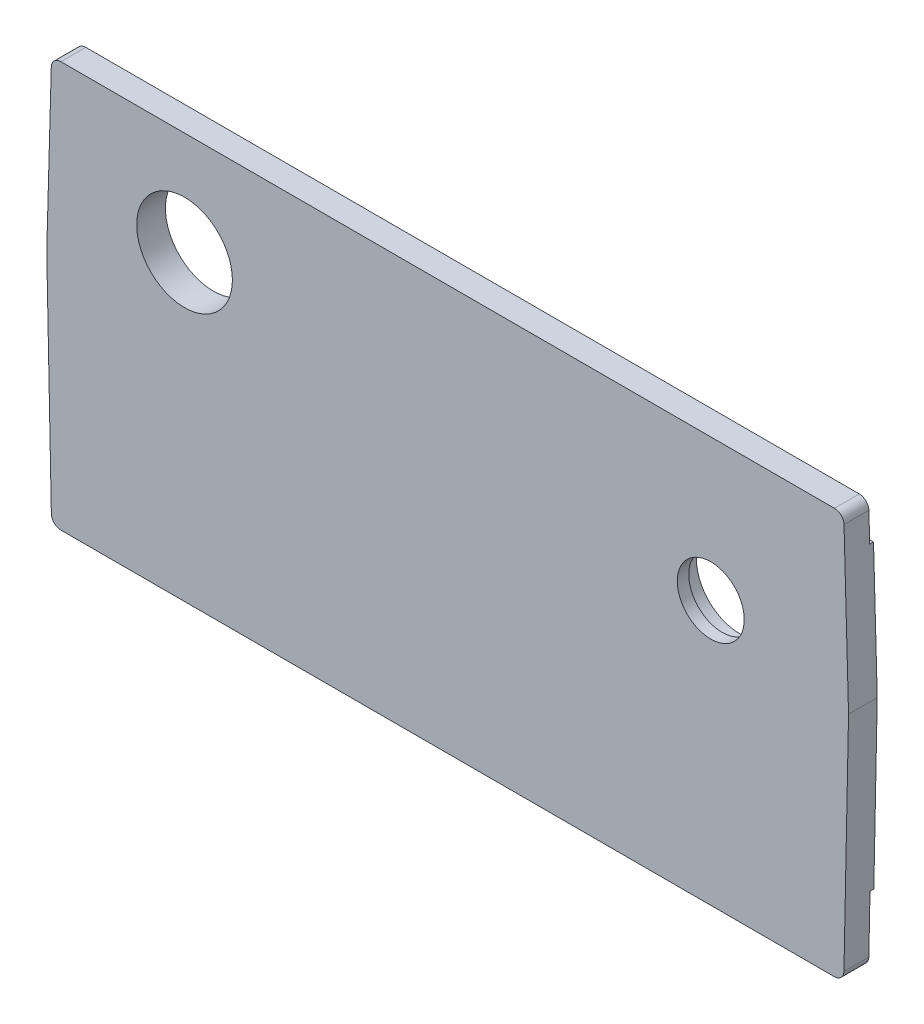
ISO-10303-21;
HEADER;
FILE_DESCRIPTION(('STEP AP214'),'2;1');
FILE_NAME('part.step','',(''),(''),'','','');
FILE_SCHEMA(('AUTOMOTIVE_DESIGN { 1 0 10303 214 1 1 1 1 }'));
ENDSEC;
DATA;
#1=APPLICATION_CONTEXT('core data for automotive mechanical design processes');
#2=APPLICATION_PROTOCOL_DEFINITION('international standard','automotive_design',2000,#1);
#3=PRODUCT_CONTEXT('',#1,'mechanical');
#4=PRODUCT('Part','Part','',(#3));
#5=PRODUCT_RELATED_PRODUCT_CATEGORY('part','',(#4));
#6=PRODUCT_DEFINITION_FORMATION('','',#4);
#7=PRODUCT_DEFINITION_CONTEXT('part definition',#1,'design');
#8=PRODUCT_DEFINITION('design','',#6,#7);
#9=PRODUCT_DEFINITION_SHAPE('','',#8);
#10=(LENGTH_UNIT() NAMED_UNIT(*) SI_UNIT(.MILLI.,.METRE.));
#11=(NAMED_UNIT(*) PLANE_ANGLE_UNIT() SI_UNIT($,.RADIAN.));
#12=(NAMED_UNIT(*) SI_UNIT($,.STERADIAN.) SOLID_ANGLE_UNIT());
#13=UNCERTAINTY_MEASURE_WITH_UNIT(LENGTH_MEASURE(1.E-05),#10,'distance_accuracy_value','');
#14=(GEOMETRIC_REPRESENTATION_CONTEXT(3) GLOBAL_UNCERTAINTY_ASSIGNED_CONTEXT((#13)) GLOBAL_UNIT_ASSIGNED_CONTEXT((#10,
#11,#12)) REPRESENTATION_CONTEXT('',''));
#15=CARTESIAN_POINT('',(0.,0.,0.));
#16=DIRECTION('',(0.,0.,1.));
#17=DIRECTION('',(1.,0.,0.));
#18=AXIS2_PLACEMENT_3D('',#15,#16,#17);
#19=CARTESIAN_POINT('',(1.47980006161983,1.,3.));
#20=DIRECTION('',(0.,0.,-1.));
#21=DIRECTION('',(-1.,0.,0.));
#22=AXIS2_PLACEMENT_3D('',#19,#20,#21);
#23=CYLINDRICAL_SURFACE('',#22,1.);
#24=CARTESIAN_POINT('',(1.47980006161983,1.,0.4));
#25=DIRECTION('',(0.,0.,-1.));
#26=DIRECTION('',(-1.,0.,0.));
#27=AXIS2_PLACEMENT_3D('',#24,#25,#26);
#28=CIRCLE('',#27,1.);
#29=CARTESIAN_POINT('',(1.47980006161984,0.,0.4));
#30=VERTEX_POINT('',#29);
#31=CARTESIAN_POINT('',(0.480008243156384,0.979596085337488,0.4));
#32=VERTEX_POINT('',#31);
#33=EDGE_CURVE('E47',#30,#32,#28,.T.);
#34=ORIENTED_EDGE('',*,*,#33,.F.);
#35=DIRECTION('',(0.,0.,-1.));
#36=VECTOR('',#35,1.);
#37=CARTESIAN_POINT('',(1.47980006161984,0.,3.));
#38=LINE('',#37,#36);
#39=CARTESIAN_POINT('',(1.47980006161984,0.,3.));
#40=VERTEX_POINT('',#39);
#41=EDGE_CURVE('E191',#40,#30,#38,.T.);
#42=ORIENTED_EDGE('',*,*,#41,.F.);
#43=CARTESIAN_POINT('',(1.47980006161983,1.,3.));
#44=DIRECTION('',(0.,0.,1.));
#45=DIRECTION('',(1.,0.,0.));
#46=AXIS2_PLACEMENT_3D('',#43,#44,#45);
#47=CIRCLE('',#46,1.);
#48=CARTESIAN_POINT('',(0.480008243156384,0.979596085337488,3.));
#49=VERTEX_POINT('',#48);
#50=EDGE_CURVE('E155',#49,#40,#47,.T.);
#51=ORIENTED_EDGE('',*,*,#50,.F.);
#52=DIRECTION('',(0.,0.,-1.));
#53=VECTOR('',#52,1.);
#54=CARTESIAN_POINT('',(0.480008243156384,0.979596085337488,3.));
#55=LINE('',#54,#53);
#56=EDGE_CURVE('E165',#49,#32,#55,.T.);
#57=ORIENTED_EDGE('',*,*,#56,.T.);
#58=EDGE_LOOP('',(#34,#42,#51,#57));
#59=FACE_BOUND('',#58,.T.);
#60=ADVANCED_FACE('F33',(#59),#23,.T.);
#61=CARTESIAN_POINT('',(1.47980006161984,0.,3.));
#62=DIRECTION('',(0.,1.,0.));
#63=DIRECTION('',(0.,0.,1.));
#64=AXIS2_PLACEMENT_3D('',#61,#62,#63);
#65=PLANE('',#64);
#66=DIRECTION('',(-1.,0.,0.));
#67=VECTOR('',#66,1.);
#68=CARTESIAN_POINT('',(85.1998639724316,0.,0.4));
#69=LINE('',#68,#67);
#70=CARTESIAN_POINT('',(82.3201999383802,0.,0.4));
#71=VERTEX_POINT('',#70);
#72=EDGE_CURVE('E148',#71,#30,#69,.T.);
#73=ORIENTED_EDGE('',*,*,#72,.F.);
#74=DIRECTION('',(0.,0.,-1.));
#75=VECTOR('',#74,1.);
#76=CARTESIAN_POINT('',(82.3201999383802,0.,3.));
#77=LINE('',#76,#75);
#78=CARTESIAN_POINT('',(82.3201999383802,0.,3.));
#79=VERTEX_POINT('',#78);
#80=EDGE_CURVE('E188',#79,#71,#77,.T.);
#81=ORIENTED_EDGE('',*,*,#80,.F.);
#82=DIRECTION('',(1.,0.,0.));
#83=VECTOR('',#82,1.);
#84=CARTESIAN_POINT('',(1.47980006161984,0.,3.));
#85=LINE('',#84,#83);
#86=EDGE_CURVE('E159',#40,#79,#85,.T.);
#87=ORIENTED_EDGE('',*,*,#86,.F.);
#88=ORIENTED_EDGE('',*,*,#41,.T.);
#89=EDGE_LOOP('',(#73,#81,#87,#88));
#90=FACE_BOUND('',#89,.T.);
#91=ADVANCED_FACE('F293',(#90),#65,.F.);
#92=CARTESIAN_POINT('',(82.3201999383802,1.,3.));
#93=DIRECTION('',(0.,0.,-1.));
#94=DIRECTION('',(-1.,0.,0.));
#95=AXIS2_PLACEMENT_3D('',#92,#93,#94);
#96=CYLINDRICAL_SURFACE('',#95,1.00000000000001);
#97=CARTESIAN_POINT('',(82.3201999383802,1.,0.4));
#98=DIRECTION('',(0.,0.,-1.));
#99=DIRECTION('',(-1.,0.,0.));
#100=AXIS2_PLACEMENT_3D('',#97,#98,#99);
#101=CIRCLE('',#100,1.00000000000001);
#102=CARTESIAN_POINT('',(83.3199917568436,0.979596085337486,0.4));
#103=VERTEX_POINT('',#102);
#104=EDGE_CURVE('E236',#103,#71,#101,.T.);
#105=ORIENTED_EDGE('',*,*,#104,.F.);
#106=DIRECTION('',(0.,0.,-1.));
#107=VECTOR('',#106,1.);
#108=CARTESIAN_POINT('',(83.3199917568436,0.979596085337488,3.));
#109=LINE('',#108,#107);
#110=CARTESIAN_POINT('',(83.3199917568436,0.979596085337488,3.));
#111=VERTEX_POINT('',#110);
#112=EDGE_CURVE('E185',#111,#103,#109,.T.);
#113=ORIENTED_EDGE('',*,*,#112,.F.);
#114=CARTESIAN_POINT('',(82.3201999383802,1.,3.));
#115=DIRECTION('',(0.,0.,1.));
#116=DIRECTION('',(-1.,0.,0.));
#117=AXIS2_PLACEMENT_3D('',#114,#115,#116);
#118=CIRCLE('',#117,1.00000000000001);
#119=EDGE_CURVE('E260',#79,#111,#118,.T.);
#120=ORIENTED_EDGE('',*,*,#119,.F.);
#121=ORIENTED_EDGE('',*,*,#80,.T.);
#122=EDGE_LOOP('',(#105,#113,#120,#121));
#123=FACE_BOUND('',#122,.T.);
#124=ADVANCED_FACE('F297',(#123),#96,.T.);
#125=CARTESIAN_POINT('',(82.3275429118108,41.4,3.));
#126=DIRECTION('',(0.,0.,-1.));
#127=DIRECTION('',(-1.,0.,0.));
#128=AXIS2_PLACEMENT_3D('',#125,#126,#127);
#129=CYLINDRICAL_SURFACE('',#128,1.);
#130=CARTESIAN_POINT('',(82.3275429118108,41.4,0.4));
#131=DIRECTION('',(0.,0.,-1.));
#132=DIRECTION('',(-1.,0.,0.));
#133=AXIS2_PLACEMENT_3D('',#130,#131,#132);
#134=CIRCLE('',#133,1.);
#135=CARTESIAN_POINT('',(82.3275429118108,42.4,0.4));
#136=VERTEX_POINT('',#135);
#137=CARTESIAN_POINT('',(83.3271530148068,41.4279220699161,0.4));
#138=VERTEX_POINT('',#137);
#139=EDGE_CURVE('E242',#136,#138,#134,.T.);
#140=ORIENTED_EDGE('',*,*,#139,.F.);
#141=DIRECTION('',(0.,0.,-1.));
#142=VECTOR('',#141,1.);
#143=CARTESIAN_POINT('',(82.3275429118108,42.4,3.));
#144=LINE('',#143,#142);
#145=CARTESIAN_POINT('',(82.3275429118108,42.4,3.));
#146=VERTEX_POINT('',#145);
#147=EDGE_CURVE('E176',#146,#136,#144,.T.);
#148=ORIENTED_EDGE('',*,*,#147,.F.);
#149=CARTESIAN_POINT('',(82.3275429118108,41.4,3.));
#150=DIRECTION('',(0.,0.,1.));
#151=DIRECTION('',(1.,0.,0.));
#152=AXIS2_PLACEMENT_3D('',#149,#150,#151);
#153=CIRCLE('',#152,1.);
#154=CARTESIAN_POINT('',(83.3271530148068,41.4279220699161,3.));
#155=VERTEX_POINT('',#154);
#156=EDGE_CURVE('E266',#155,#146,#153,.T.);
#157=ORIENTED_EDGE('',*,*,#156,.F.);
#158=DIRECTION('',(0.,0.,-1.));
#159=VECTOR('',#158,1.);
#160=CARTESIAN_POINT('',(83.3271530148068,41.4279220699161,3.));
#161=LINE('',#160,#159);
#162=EDGE_CURVE('E179',#155,#138,#161,.T.);
#163=ORIENTED_EDGE('',*,*,#162,.T.);
#164=EDGE_LOOP('',(#140,#148,#157,#163));
#165=FACE_BOUND('',#164,.T.);
#166=ADVANCED_FACE('F302',(#165),#129,.T.);
#167=CARTESIAN_POINT('',(1.47245708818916,42.4,3.));
#168=DIRECTION('',(0.,-1.,0.));
#169=DIRECTION('',(0.,0.,-1.));
#170=AXIS2_PLACEMENT_3D('',#167,#168,#169);
#171=PLANE('',#170);
#172=DIRECTION('',(1.,0.,0.));
#173=VECTOR('',#172,1.);
#174=CARTESIAN_POINT('',(85.1998639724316,42.4,0.4));
#175=LINE('',#174,#173);
#176=CARTESIAN_POINT('',(1.47245708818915,42.4,0.4));
#177=VERTEX_POINT('',#176);
#178=EDGE_CURVE('E234',#177,#136,#175,.T.);
#179=ORIENTED_EDGE('',*,*,#178,.F.);
#180=DIRECTION('',(0.,0.,-1.));
#181=VECTOR('',#180,1.);
#182=CARTESIAN_POINT('',(1.47245708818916,42.4,3.));
#183=LINE('',#182,#181);
#184=CARTESIAN_POINT('',(1.47245708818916,42.4,3.));
#185=VERTEX_POINT('',#184);
#186=EDGE_CURVE('E173',#185,#177,#183,.T.);
#187=ORIENTED_EDGE('',*,*,#186,.F.);
#188=DIRECTION('',(-1.,0.,0.));
#189=VECTOR('',#188,1.);
#190=CARTESIAN_POINT('',(1.47245708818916,42.4,3.));
#191=LINE('',#190,#189);
#192=EDGE_CURVE('E268',#146,#185,#191,.T.);
#193=ORIENTED_EDGE('',*,*,#192,.F.);
#194=ORIENTED_EDGE('',*,*,#147,.T.);
#195=EDGE_LOOP('',(#179,#187,#193,#194));
#196=FACE_BOUND('',#195,.T.);
#197=ADVANCED_FACE('F315',(#196),#171,.F.);
#198=CARTESIAN_POINT('',(1.47245708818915,41.4,3.));
#199=DIRECTION('',(0.,0.,-1.));
#200=DIRECTION('',(-1.,0.,0.));
#201=AXIS2_PLACEMENT_3D('',#198,#199,#200);
#202=CYLINDRICAL_SURFACE('',#201,1.);
#203=CARTESIAN_POINT('',(1.47245708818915,41.4,0.4));
#204=DIRECTION('',(0.,0.,-1.));
#205=DIRECTION('',(-1.,0.,0.));
#206=AXIS2_PLACEMENT_3D('',#203,#204,#205);
#207=CIRCLE('',#206,1.);
#208=CARTESIAN_POINT('',(0.472846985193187,41.4279220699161,0.4));
#209=VERTEX_POINT('',#208);
#210=EDGE_CURVE('E240',#209,#177,#207,.T.);
#211=ORIENTED_EDGE('',*,*,#210,.F.);
#212=DIRECTION('',(0.,0.,-1.));
#213=VECTOR('',#212,1.);
#214=CARTESIAN_POINT('',(0.472846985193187,41.4279220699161,3.));
#215=LINE('',#214,#213);
#216=CARTESIAN_POINT('',(0.472846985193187,41.4279220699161,3.));
#217=VERTEX_POINT('',#216);
#218=EDGE_CURVE('E170',#217,#209,#215,.T.);
#219=ORIENTED_EDGE('',*,*,#218,.F.);
#220=CARTESIAN_POINT('',(1.47245708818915,41.4,3.));
#221=DIRECTION('',(0.,0.,1.));
#222=DIRECTION('',(-1.,0.,0.));
#223=AXIS2_PLACEMENT_3D('',#220,#221,#222);
#224=CIRCLE('',#223,1.);
#225=EDGE_CURVE('E216',#185,#217,#224,.T.);
#226=ORIENTED_EDGE('',*,*,#225,.F.);
#227=ORIENTED_EDGE('',*,*,#186,.T.);
#228=EDGE_LOOP('',(#211,#219,#226,#227));
#229=FACE_BOUND('',#228,.T.);
#230=ADVANCED_FACE('F275',(#229),#202,.T.);
#231=CARTESIAN_POINT('',(69.4,27.6,3.));
#232=DIRECTION('',(0.,0.,-1.));
#233=DIRECTION('',(-1.,0.,0.));
#234=AXIS2_PLACEMENT_3D('',#231,#232,#233);
#235=CYLINDRICAL_SURFACE('',#234,3.50000000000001);
#236=CARTESIAN_POINT('',(69.4,27.6,3.));
#237=DIRECTION('',(0.,0.,1.));
#238=DIRECTION('',(1.,0.,0.));
#239=AXIS2_PLACEMENT_3D('',#236,#237,#238);
#240=CIRCLE('',#239,3.50000000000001);
#241=CARTESIAN_POINT('',(72.9,27.6,3.));
#242=VERTEX_POINT('',#241);
#243=EDGE_CURVE('E198',#242,#242,#240,.T.);
#244=ORIENTED_EDGE('',*,*,#243,.T.);
#245=EDGE_LOOP('',(#244));
#246=FACE_BOUND('',#245,.T.);
#247=CARTESIAN_POINT('',(69.4,27.6,1.8));
#248=DIRECTION('',(0.,0.,-1.));
#249=DIRECTION('',(-1.,0.,0.));
#250=AXIS2_PLACEMENT_3D('',#247,#248,#249);
#251=CIRCLE('',#250,3.50000000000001);
#252=CARTESIAN_POINT('',(65.9,27.6,1.8));
#253=VERTEX_POINT('',#252);
#254=EDGE_CURVE('E195',#253,#253,#251,.T.);
#255=ORIENTED_EDGE('',*,*,#254,.T.);
#256=EDGE_LOOP('',(#255));
#257=FACE_BOUND('',#256,.T.);
#258=ADVANCED_FACE('F322',(#246,#257),#235,.F.);
#259=CARTESIAN_POINT('',(1.47980006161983,1.,3.));
#260=DIRECTION('',(0.,0.,1.));
#261=DIRECTION('',(1.,0.,0.));
#262=AXIS2_PLACEMENT_3D('',#259,#260,#261);
#263=PLANE('',#262);
#264=CARTESIAN_POINT('',(14.4,31.6,3.));
#265=DIRECTION('',(0.,0.,1.));
#266=DIRECTION('',(1.,0.,0.));
#267=AXIS2_PLACEMENT_3D('',#264,#265,#266);
#268=CIRCLE('',#267,5.);
#269=CARTESIAN_POINT('',(19.4,31.6,3.));
#270=VERTEX_POINT('',#269);
#271=EDGE_CURVE('E220',#270,#270,#268,.T.);
#272=ORIENTED_EDGE('',*,*,#271,.F.);
#273=EDGE_LOOP('',(#272));
#274=FACE_BOUND('',#273,.T.);
#275=ORIENTED_EDGE('',*,*,#50,.T.);
#276=ORIENTED_EDGE('',*,*,#86,.T.);
#277=ORIENTED_EDGE('',*,*,#119,.T.);
#278=DIRECTION('',(0.0204039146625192,0.999791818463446,0.));
#279=VECTOR('',#278,1.);
#280=CARTESIAN_POINT('',(83.8,24.5,3.));
#281=LINE('',#280,#279);
#282=CARTESIAN_POINT('',(83.8,24.5,3.));
#283=VERTEX_POINT('',#282);
#284=EDGE_CURVE('E262',#111,#283,#281,.T.);
#285=ORIENTED_EDGE('',*,*,#284,.T.);
#286=DIRECTION('',(-0.0279220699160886,0.999610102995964,0.));
#287=VECTOR('',#286,1.);
#288=CARTESIAN_POINT('',(83.3271530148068,41.4279220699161,3.));
#289=LINE('',#288,#287);
#290=EDGE_CURVE('E264',#283,#155,#289,.T.);
#291=ORIENTED_EDGE('',*,*,#290,.T.);
#292=ORIENTED_EDGE('',*,*,#156,.T.);
#293=ORIENTED_EDGE('',*,*,#192,.T.);
#294=ORIENTED_EDGE('',*,*,#225,.T.);
#295=DIRECTION('',(-0.0279220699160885,-0.999610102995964,0.));
#296=VECTOR('',#295,1.);
#297=CARTESIAN_POINT('',(0.472846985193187,41.4279220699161,3.));
#298=LINE('',#297,#296);
#299=CARTESIAN_POINT('',(0.,24.5,3.));
#300=VERTEX_POINT('',#299);
#301=EDGE_CURVE('E214',#217,#300,#298,.T.);
#302=ORIENTED_EDGE('',*,*,#301,.T.);
#303=DIRECTION('',(0.0204039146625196,-0.999791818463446,0.));
#304=VECTOR('',#303,1.);
#305=CARTESIAN_POINT('',(0.,24.5,3.));
#306=LINE('',#305,#304);
#307=EDGE_CURVE('E168',#300,#49,#306,.T.);
#308=ORIENTED_EDGE('',*,*,#307,.T.);
#309=EDGE_LOOP('',(#275,#276,#277,#285,#291,#292,#293,#294,#302,#308));
#310=FACE_BOUND('',#309,.T.);
#311=ORIENTED_EDGE('',*,*,#243,.F.);
#312=EDGE_LOOP('',(#311));
#313=FACE_BOUND('',#312,.T.);
#314=ADVANCED_FACE('F210',(#274,#310,#313),#263,.T.);
#315=CARTESIAN_POINT('',(1.47980006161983,1.,0.));
#316=DIRECTION('',(0.,0.,1.));
#317=DIRECTION('',(1.,0.,0.));
#318=AXIS2_PLACEMENT_3D('',#315,#316,#317);
#319=PLANE('',#318);
#320=CARTESIAN_POINT('',(69.4,27.6,0.));
#321=DIRECTION('',(0.,0.,-1.));
#322=DIRECTION('',(-1.,0.,0.));
#323=AXIS2_PLACEMENT_3D('',#320,#321,#322);
#324=CIRCLE('',#323,4.5);
#325=CARTESIAN_POINT('',(64.9,27.6,0.));
#326=VERTEX_POINT('',#325);
#327=EDGE_CURVE('E247',#326,#326,#324,.T.);
#328=ORIENTED_EDGE('',*,*,#327,.F.);
#329=EDGE_LOOP('',(#328));
#330=FACE_BOUND('',#329,.T.);
#331=CARTESIAN_POINT('',(14.4,31.6,0.));
#332=DIRECTION('',(0.,0.,1.));
#333=DIRECTION('',(1.,0.,0.));
#334=AXIS2_PLACEMENT_3D('',#331,#332,#333);
#335=CIRCLE('',#334,5.);
#336=CARTESIAN_POINT('',(19.4,31.6,0.));
#337=VERTEX_POINT('',#336);
#338=EDGE_CURVE('E254',#337,#337,#335,.T.);
#339=ORIENTED_EDGE('',*,*,#338,.T.);
#340=EDGE_LOOP('',(#339));
#341=FACE_BOUND('',#340,.T.);
#342=DIRECTION('',(0.0204039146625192,0.999791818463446,0.));
#343=VECTOR('',#342,1.);
#344=CARTESIAN_POINT('',(83.8,24.5,0.));
#345=LINE('',#344,#343);
#346=CARTESIAN_POINT('',(83.4428571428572,6.99999999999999,0.));
#347=VERTEX_POINT('',#346);
#348=CARTESIAN_POINT('',(83.8,24.5,0.));
#349=VERTEX_POINT('',#348);
#350=EDGE_CURVE('E147',#347,#349,#345,.T.);
#351=ORIENTED_EDGE('',*,*,#350,.F.);
#352=DIRECTION('',(1.,0.,0.));
#353=VECTOR('',#352,1.);
#354=CARTESIAN_POINT('',(85.1998639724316,6.99999999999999,0.));
#355=LINE('',#354,#353);
#356=CARTESIAN_POINT('',(0.357142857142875,6.99999999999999,0.));
#357=VERTEX_POINT('',#356);
#358=EDGE_CURVE('E134',#357,#347,#355,.T.);
#359=ORIENTED_EDGE('',*,*,#358,.F.);
#360=DIRECTION('',(0.0204039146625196,-0.999791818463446,0.));
#361=VECTOR('',#360,1.);
#362=CARTESIAN_POINT('',(0.,24.5,0.));
#363=LINE('',#362,#361);
#364=CARTESIAN_POINT('',(0.,24.5,0.));
#365=VERTEX_POINT('',#364);
#366=EDGE_CURVE('E145',#365,#357,#363,.T.);
#367=ORIENTED_EDGE('',*,*,#366,.F.);
#368=DIRECTION('',(-0.0279220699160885,-0.999610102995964,0.));
#369=VECTOR('',#368,1.);
#370=CARTESIAN_POINT('',(0.472846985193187,41.4279220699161,0.));
#371=LINE('',#370,#369);
#372=CARTESIAN_POINT('',(0.388268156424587,38.4,0.));
#373=VERTEX_POINT('',#372);
#374=EDGE_CURVE('E156',#373,#365,#371,.T.);
#375=ORIENTED_EDGE('',*,*,#374,.F.);
#376=DIRECTION('',(-1.,0.,0.));
#377=VECTOR('',#376,1.);
#378=CARTESIAN_POINT('',(85.1998639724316,38.4,0.));
#379=LINE('',#378,#377);
#380=CARTESIAN_POINT('',(83.4117318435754,38.4,0.));
#381=VERTEX_POINT('',#380);
#382=EDGE_CURVE('E230',#381,#373,#379,.T.);
#383=ORIENTED_EDGE('',*,*,#382,.F.);
#384=DIRECTION('',(-0.0279220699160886,0.999610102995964,0.));
#385=VECTOR('',#384,1.);
#386=CARTESIAN_POINT('',(83.3271530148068,41.4279220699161,0.));
#387=LINE('',#386,#385);
#388=EDGE_CURVE('E161',#349,#381,#387,.T.);
#389=ORIENTED_EDGE('',*,*,#388,.F.);
#390=EDGE_LOOP('',(#351,#359,#367,#375,#383,#389));
#391=FACE_BOUND('',#390,.T.);
#392=ADVANCED_FACE('F143',(#330,#341,#391),#319,.F.);
#393=CARTESIAN_POINT('',(83.8,24.5,3.));
#394=DIRECTION('',(-0.999791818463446,0.0204039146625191,0.));
#395=DIRECTION('',(-0.0204039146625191,-0.999791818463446,0.));
#396=AXIS2_PLACEMENT_3D('',#393,#394,#395);
#397=PLANE('',#396);
#398=DIRECTION('',(-0.0204039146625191,-0.999791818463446,0.));
#399=VECTOR('',#398,1.);
#400=CARTESIAN_POINT('',(83.8,24.5,0.4));
#401=LINE('',#400,#399);
#402=CARTESIAN_POINT('',(83.4428571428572,6.99999999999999,0.4));
#403=VERTEX_POINT('',#402);
#404=EDGE_CURVE('E479',#403,#103,#401,.T.);
#405=ORIENTED_EDGE('',*,*,#404,.F.);
#406=DIRECTION('',(0.,0.,-1.));
#407=VECTOR('',#406,1.);
#408=CARTESIAN_POINT('',(83.4428571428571,6.99999999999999,3.));
#409=LINE('',#408,#407);
#410=EDGE_CURVE('E232',#403,#347,#409,.T.);
#411=ORIENTED_EDGE('',*,*,#410,.T.);
#412=ORIENTED_EDGE('',*,*,#350,.T.);
#413=DIRECTION('',(0.,0.,-1.));
#414=VECTOR('',#413,1.);
#415=CARTESIAN_POINT('',(83.8,24.5,3.));
#416=LINE('',#415,#414);
#417=EDGE_CURVE('E182',#283,#349,#416,.T.);
#418=ORIENTED_EDGE('',*,*,#417,.F.);
#419=ORIENTED_EDGE('',*,*,#284,.F.);
#420=ORIENTED_EDGE('',*,*,#112,.T.);
#421=EDGE_LOOP('',(#405,#411,#412,#418,#419,#420));
#422=FACE_BOUND('',#421,.T.);
#423=ADVANCED_FACE('F307',(#422),#397,.F.);
#424=CARTESIAN_POINT('',(83.3271530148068,41.4279220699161,3.));
#425=DIRECTION('',(-0.999610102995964,-0.0279220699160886,0.));
#426=DIRECTION('',(0.0279220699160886,-0.999610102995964,0.));
#427=AXIS2_PLACEMENT_3D('',#424,#425,#426);
#428=PLANE('',#427);
#429=ORIENTED_EDGE('',*,*,#388,.T.);
#430=DIRECTION('',(0.,0.,1.));
#431=VECTOR('',#430,1.);
#432=CARTESIAN_POINT('',(83.4117318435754,38.4,3.));
#433=LINE('',#432,#431);
#434=CARTESIAN_POINT('',(83.4117318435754,38.4,0.4));
#435=VERTEX_POINT('',#434);
#436=EDGE_CURVE('E226',#381,#435,#433,.T.);
#437=ORIENTED_EDGE('',*,*,#436,.T.);
#438=DIRECTION('',(0.0279220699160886,-0.999610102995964,0.));
#439=VECTOR('',#438,1.);
#440=CARTESIAN_POINT('',(83.3271530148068,41.4279220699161,0.4));
#441=LINE('',#440,#439);
#442=EDGE_CURVE('E244',#138,#435,#441,.T.);
#443=ORIENTED_EDGE('',*,*,#442,.F.);
#444=ORIENTED_EDGE('',*,*,#162,.F.);
#445=ORIENTED_EDGE('',*,*,#290,.F.);
#446=ORIENTED_EDGE('',*,*,#417,.T.);
#447=EDGE_LOOP('',(#429,#437,#443,#444,#445,#446));
#448=FACE_BOUND('',#447,.T.);
#449=ADVANCED_FACE('F224',(#448),#428,.F.);
#450=CARTESIAN_POINT('',(0.472846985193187,41.4279220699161,3.));
#451=DIRECTION('',(0.999610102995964,-0.0279220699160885,0.));
#452=DIRECTION('',(0.0279220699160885,0.999610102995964,0.));
#453=AXIS2_PLACEMENT_3D('',#450,#451,#452);
#454=PLANE('',#453);
#455=DIRECTION('',(0.0279220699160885,0.999610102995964,0.));
#456=VECTOR('',#455,1.);
#457=CARTESIAN_POINT('',(0.472846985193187,41.4279220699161,0.4));
#458=LINE('',#457,#456);
#459=CARTESIAN_POINT('',(0.388268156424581,38.4,0.4));
#460=VERTEX_POINT('',#459);
#461=EDGE_CURVE('E194',#460,#209,#458,.T.);
#462=ORIENTED_EDGE('',*,*,#461,.F.);
#463=DIRECTION('',(0.,0.,-1.));
#464=VECTOR('',#463,1.);
#465=CARTESIAN_POINT('',(0.388268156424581,38.4,3.));
#466=LINE('',#465,#464);
#467=EDGE_CURVE('E201',#460,#373,#466,.T.);
#468=ORIENTED_EDGE('',*,*,#467,.T.);
#469=ORIENTED_EDGE('',*,*,#374,.T.);
#470=DIRECTION('',(0.,0.,-1.));
#471=VECTOR('',#470,1.);
#472=CARTESIAN_POINT('',(0.,24.5,3.));
#473=LINE('',#472,#471);
#474=EDGE_CURVE('E154',#300,#365,#473,.T.);
#475=ORIENTED_EDGE('',*,*,#474,.F.);
#476=ORIENTED_EDGE('',*,*,#301,.F.);
#477=ORIENTED_EDGE('',*,*,#218,.T.);
#478=EDGE_LOOP('',(#462,#468,#469,#475,#476,#477));
#479=FACE_BOUND('',#478,.T.);
#480=ADVANCED_FACE('F278',(#479),#454,.F.);
#481=CARTESIAN_POINT('',(0.,24.5,3.));
#482=DIRECTION('',(0.999791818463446,0.0204039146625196,0.));
#483=DIRECTION('',(-0.0204039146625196,0.999791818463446,0.));
#484=AXIS2_PLACEMENT_3D('',#481,#482,#483);
#485=PLANE('',#484);
#486=ORIENTED_EDGE('',*,*,#366,.T.);
#487=DIRECTION('',(0.,0.,1.));
#488=VECTOR('',#487,1.);
#489=CARTESIAN_POINT('',(0.357142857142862,6.99999999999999,3.));
#490=LINE('',#489,#488);
#491=CARTESIAN_POINT('',(0.357142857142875,6.99999999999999,0.4));
#492=VERTEX_POINT('',#491);
#493=EDGE_CURVE('E11',#357,#492,#490,.T.);
#494=ORIENTED_EDGE('',*,*,#493,.T.);
#495=DIRECTION('',(-0.0204039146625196,0.999791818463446,0.));
#496=VECTOR('',#495,1.);
#497=CARTESIAN_POINT('',(0.,24.5,0.4));
#498=LINE('',#497,#496);
#499=EDGE_CURVE('E40',#32,#492,#498,.T.);
#500=ORIENTED_EDGE('',*,*,#499,.F.);
#501=ORIENTED_EDGE('',*,*,#56,.F.);
#502=ORIENTED_EDGE('',*,*,#307,.F.);
#503=ORIENTED_EDGE('',*,*,#474,.T.);
#504=EDGE_LOOP('',(#486,#494,#500,#501,#502,#503));
#505=FACE_BOUND('',#504,.T.);
#506=ADVANCED_FACE('F151',(#505),#485,.F.);
#507=CARTESIAN_POINT('',(14.4,31.6,3.));
#508=DIRECTION('',(0.,0.,-1.));
#509=DIRECTION('',(-1.,0.,0.));
#510=AXIS2_PLACEMENT_3D('',#507,#508,#509);
#511=CYLINDRICAL_SURFACE('',#510,5.);
#512=ORIENTED_EDGE('',*,*,#271,.T.);
#513=EDGE_LOOP('',(#512));
#514=FACE_BOUND('',#513,.T.);
#515=ORIENTED_EDGE('',*,*,#338,.F.);
#516=EDGE_LOOP('',(#515));
#517=FACE_BOUND('',#516,.T.);
#518=ADVANCED_FACE('F327',(#514,#517),#511,.F.);
#519=CARTESIAN_POINT('',(69.4,27.6,1.8));
#520=DIRECTION('',(0.,0.,-1.));
#521=DIRECTION('',(-1.,0.,0.));
#522=AXIS2_PLACEMENT_3D('',#519,#520,#521);
#523=CYLINDRICAL_SURFACE('',#522,4.5);
#524=CARTESIAN_POINT('',(69.4,27.6,1.8));
#525=DIRECTION('',(0.,0.,-1.));
#526=DIRECTION('',(-1.,0.,0.));
#527=AXIS2_PLACEMENT_3D('',#524,#525,#526);
#528=CIRCLE('',#527,4.5);
#529=CARTESIAN_POINT('',(64.9,27.6,1.8));
#530=VERTEX_POINT('',#529);
#531=EDGE_CURVE('E199',#530,#530,#528,.T.);
#532=ORIENTED_EDGE('',*,*,#531,.F.);
#533=EDGE_LOOP('',(#532));
#534=FACE_BOUND('',#533,.T.);
#535=ORIENTED_EDGE('',*,*,#327,.T.);
#536=EDGE_LOOP('',(#535));
#537=FACE_BOUND('',#536,.T.);
#538=ADVANCED_FACE('F289',(#534,#537),#523,.F.);
#539=CARTESIAN_POINT('',(69.4,27.6,1.8));
#540=DIRECTION('',(0.,0.,-1.));
#541=DIRECTION('',(-1.,0.,0.));
#542=AXIS2_PLACEMENT_3D('',#539,#540,#541);
#543=PLANE('',#542);
#544=ORIENTED_EDGE('',*,*,#254,.F.);
#545=EDGE_LOOP('',(#544));
#546=FACE_BOUND('',#545,.T.);
#547=ORIENTED_EDGE('',*,*,#531,.T.);
#548=EDGE_LOOP('',(#547));
#549=FACE_BOUND('',#548,.T.);
#550=ADVANCED_FACE('F282',(#546,#549),#543,.T.);
#551=CARTESIAN_POINT('',(85.1998639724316,38.4,0.4));
#552=DIRECTION('',(0.,-1.,0.));
#553=DIRECTION('',(0.,0.,-1.));
#554=AXIS2_PLACEMENT_3D('',#551,#552,#553);
#555=PLANE('',#554);
#556=ORIENTED_EDGE('',*,*,#382,.T.);
#557=ORIENTED_EDGE('',*,*,#467,.F.);
#558=DIRECTION('',(-1.,0.,0.));
#559=VECTOR('',#558,1.);
#560=CARTESIAN_POINT('',(85.1998639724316,38.4,0.4));
#561=LINE('',#560,#559);
#562=EDGE_CURVE('E55',#435,#460,#561,.T.);
#563=ORIENTED_EDGE('',*,*,#562,.F.);
#564=ORIENTED_EDGE('',*,*,#436,.F.);
#565=EDGE_LOOP('',(#556,#557,#563,#564));
#566=FACE_BOUND('',#565,.T.);
#567=ADVANCED_FACE('F279',(#566),#555,.F.);
#568=CARTESIAN_POINT('',(85.1998639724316,38.4,0.4));
#569=DIRECTION('',(0.,0.,-1.));
#570=DIRECTION('',(-1.,0.,0.));
#571=AXIS2_PLACEMENT_3D('',#568,#569,#570);
#572=PLANE('',#571);
#573=ORIENTED_EDGE('',*,*,#442,.T.);
#574=ORIENTED_EDGE('',*,*,#562,.T.);
#575=ORIENTED_EDGE('',*,*,#461,.T.);
#576=ORIENTED_EDGE('',*,*,#210,.T.);
#577=ORIENTED_EDGE('',*,*,#178,.T.);
#578=ORIENTED_EDGE('',*,*,#139,.T.);
#579=EDGE_LOOP('',(#573,#574,#575,#576,#577,#578));
#580=FACE_BOUND('',#579,.T.);
#581=ADVANCED_FACE('F281',(#580),#572,.T.);
#582=CARTESIAN_POINT('',(85.1998639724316,6.99999999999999,0.4));
#583=DIRECTION('',(0.,1.,0.));
#584=DIRECTION('',(0.,0.,1.));
#585=AXIS2_PLACEMENT_3D('',#582,#583,#584);
#586=PLANE('',#585);
#587=DIRECTION('',(1.,0.,0.));
#588=VECTOR('',#587,1.);
#589=CARTESIAN_POINT('',(85.1998639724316,6.99999999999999,0.4));
#590=LINE('',#589,#588);
#591=EDGE_CURVE('E137',#492,#403,#590,.T.);
#592=ORIENTED_EDGE('',*,*,#591,.F.);
#593=ORIENTED_EDGE('',*,*,#493,.F.);
#594=ORIENTED_EDGE('',*,*,#358,.T.);
#595=ORIENTED_EDGE('',*,*,#410,.F.);
#596=EDGE_LOOP('',(#592,#593,#594,#595));
#597=FACE_BOUND('',#596,.T.);
#598=ADVANCED_FACE('F133',(#597),#586,.F.);
#599=CARTESIAN_POINT('',(85.1998639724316,0.,0.4));
#600=DIRECTION('',(0.,0.,-1.));
#601=DIRECTION('',(-1.,0.,0.));
#602=AXIS2_PLACEMENT_3D('',#599,#600,#601);
#603=PLANE('',#602);
#604=ORIENTED_EDGE('',*,*,#104,.T.);
#605=ORIENTED_EDGE('',*,*,#72,.T.);
#606=ORIENTED_EDGE('',*,*,#33,.T.);
#607=ORIENTED_EDGE('',*,*,#499,.T.);
#608=ORIENTED_EDGE('',*,*,#591,.T.);
#609=ORIENTED_EDGE('',*,*,#404,.T.);
#610=EDGE_LOOP('',(#604,#605,#606,#607,#608,#609));
#611=FACE_BOUND('',#610,.T.);
#612=ADVANCED_FACE('F203',(#611),#603,.T.);
#613=CLOSED_SHELL('',(#60,#91,#124,#166,#197,#230,#258,#314,#392,#423,#449,#480,#506,#518,#538,
#550,#567,#581,#598,#612));
#614=MANIFOLD_SOLID_BREP('B2',#613);
#615=ADVANCED_BREP_SHAPE_REPRESENTATION('',(#18,#614),#14);
#616=SHAPE_DEFINITION_REPRESENTATION(#9,#615);
ENDSEC;
END-ISO-10303-21;
